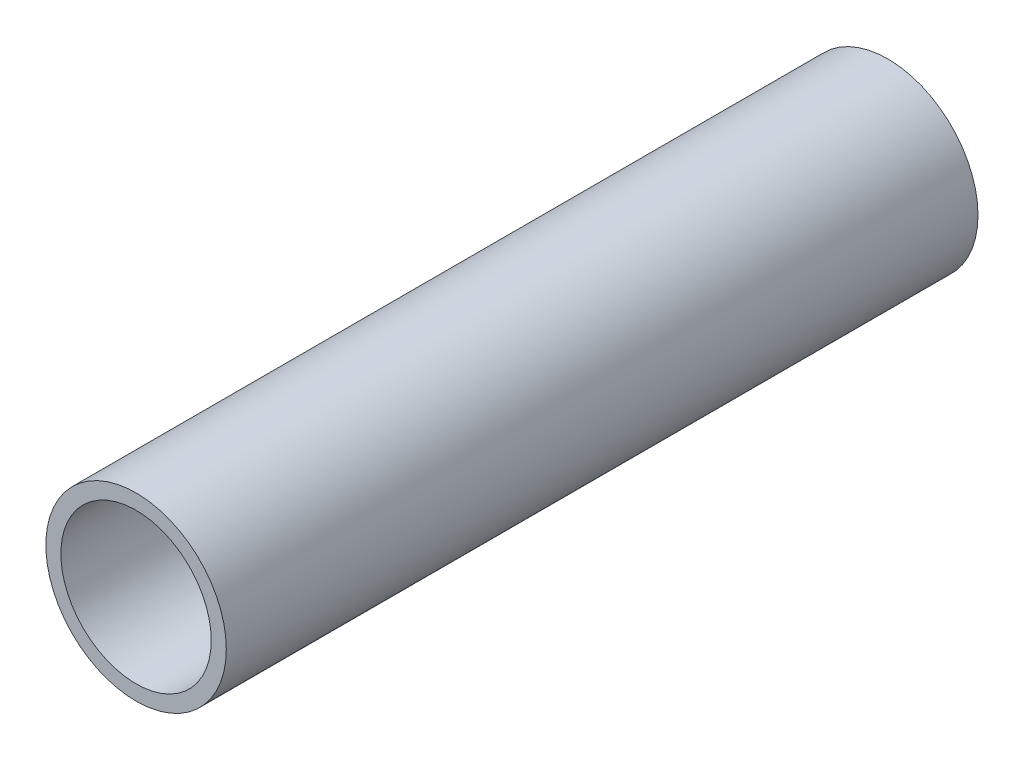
ISO-10303-21;
HEADER;
FILE_DESCRIPTION(('STEP AP214'),'2;1');
FILE_NAME('part.step','',(''),(''),'','','');
FILE_SCHEMA(('AUTOMOTIVE_DESIGN { 1 0 10303 214 1 1 1 1 }'));
ENDSEC;
DATA;
#1=APPLICATION_CONTEXT('core data for automotive mechanical design processes');
#2=APPLICATION_PROTOCOL_DEFINITION('international standard','automotive_design',2000,#1);
#3=PRODUCT_CONTEXT('',#1,'mechanical');
#4=PRODUCT('Part','Part','',(#3));
#5=PRODUCT_RELATED_PRODUCT_CATEGORY('part','',(#4));
#6=PRODUCT_DEFINITION_FORMATION('','',#4);
#7=PRODUCT_DEFINITION_CONTEXT('part definition',#1,'design');
#8=PRODUCT_DEFINITION('design','',#6,#7);
#9=PRODUCT_DEFINITION_SHAPE('','',#8);
#10=(LENGTH_UNIT() NAMED_UNIT(*) SI_UNIT(.MILLI.,.METRE.));
#11=(NAMED_UNIT(*) PLANE_ANGLE_UNIT() SI_UNIT($,.RADIAN.));
#12=(NAMED_UNIT(*) SI_UNIT($,.STERADIAN.) SOLID_ANGLE_UNIT());
#13=UNCERTAINTY_MEASURE_WITH_UNIT(LENGTH_MEASURE(1.E-05),#10,'distance_accuracy_value','');
#14=(GEOMETRIC_REPRESENTATION_CONTEXT(3) GLOBAL_UNCERTAINTY_ASSIGNED_CONTEXT((#13)) GLOBAL_UNIT_ASSIGNED_CONTEXT((#10,
#11,#12)) REPRESENTATION_CONTEXT('',''));
#15=CARTESIAN_POINT('',(0.,0.,0.));
#16=DIRECTION('',(0.,0.,1.));
#17=DIRECTION('',(1.,0.,0.));
#18=AXIS2_PLACEMENT_3D('',#15,#16,#17);
#19=CARTESIAN_POINT('',(0.,0.,249.95));
#20=DIRECTION('',(0.,0.,1.));
#21=DIRECTION('',(1.,0.,0.));
#22=AXIS2_PLACEMENT_3D('',#19,#20,#21);
#23=PLANE('',#22);
#24=CARTESIAN_POINT('',(0.,0.,249.95));
#25=DIRECTION('',(0.,0.,1.));
#26=DIRECTION('',(1.,0.,0.));
#27=AXIS2_PLACEMENT_3D('',#24,#25,#26);
#28=CIRCLE('',#27,60.);
#29=CARTESIAN_POINT('',(60.,0.,249.95));
#30=VERTEX_POINT('',#29);
#31=EDGE_CURVE('E10',#30,#30,#28,.T.);
#32=ORIENTED_EDGE('',*,*,#31,.T.);
#33=EDGE_LOOP('',(#32));
#34=FACE_BOUND('',#33,.T.);
#35=CARTESIAN_POINT('',(0.,0.,249.95));
#36=DIRECTION('',(0.,0.,1.));
#37=DIRECTION('',(1.,0.,0.));
#38=AXIS2_PLACEMENT_3D('',#35,#36,#37);
#39=CIRCLE('',#38,50.);
#40=CARTESIAN_POINT('',(50.,0.,249.95));
#41=VERTEX_POINT('',#40);
#42=EDGE_CURVE('E46',#41,#41,#39,.T.);
#43=ORIENTED_EDGE('',*,*,#42,.F.);
#44=EDGE_LOOP('',(#43));
#45=FACE_BOUND('',#44,.T.);
#46=ADVANCED_FACE('F35',(#34,#45),#23,.T.);
#47=CARTESIAN_POINT('',(0.,0.,-249.95));
#48=DIRECTION('',(0.,0.,1.));
#49=DIRECTION('',(1.,0.,0.));
#50=AXIS2_PLACEMENT_3D('',#47,#48,#49);
#51=PLANE('',#50);
#52=CARTESIAN_POINT('',(0.,0.,-249.95));
#53=DIRECTION('',(0.,0.,1.));
#54=DIRECTION('',(1.,0.,0.));
#55=AXIS2_PLACEMENT_3D('',#52,#53,#54);
#56=CIRCLE('',#55,60.);
#57=CARTESIAN_POINT('',(60.,0.,-249.95));
#58=VERTEX_POINT('',#57);
#59=EDGE_CURVE('E42',#58,#58,#56,.T.);
#60=ORIENTED_EDGE('',*,*,#59,.F.);
#61=EDGE_LOOP('',(#60));
#62=FACE_BOUND('',#61,.T.);
#63=CARTESIAN_POINT('',(0.,0.,-249.95));
#64=DIRECTION('',(0.,0.,1.));
#65=DIRECTION('',(1.,0.,0.));
#66=AXIS2_PLACEMENT_3D('',#63,#64,#65);
#67=CIRCLE('',#66,50.);
#68=CARTESIAN_POINT('',(50.,0.,-249.95));
#69=VERTEX_POINT('',#68);
#70=EDGE_CURVE('E50',#69,#69,#67,.T.);
#71=ORIENTED_EDGE('',*,*,#70,.T.);
#72=EDGE_LOOP('',(#71));
#73=FACE_BOUND('',#72,.T.);
#74=ADVANCED_FACE('F56',(#62,#73),#51,.F.);
#75=CARTESIAN_POINT('',(0.,0.,249.95));
#76=DIRECTION('',(0.,0.,-1.));
#77=DIRECTION('',(-1.,0.,0.));
#78=AXIS2_PLACEMENT_3D('',#75,#76,#77);
#79=CYLINDRICAL_SURFACE('',#78,60.);
#80=ORIENTED_EDGE('',*,*,#31,.F.);
#81=EDGE_LOOP('',(#80));
#82=FACE_BOUND('',#81,.T.);
#83=ORIENTED_EDGE('',*,*,#59,.T.);
#84=EDGE_LOOP('',(#83));
#85=FACE_BOUND('',#84,.T.);
#86=ADVANCED_FACE('F37',(#82,#85),#79,.T.);
#87=CARTESIAN_POINT('',(0.,0.,249.95));
#88=DIRECTION('',(0.,0.,-1.));
#89=DIRECTION('',(-1.,0.,0.));
#90=AXIS2_PLACEMENT_3D('',#87,#88,#89);
#91=CYLINDRICAL_SURFACE('',#90,50.);
#92=ORIENTED_EDGE('',*,*,#42,.T.);
#93=EDGE_LOOP('',(#92));
#94=FACE_BOUND('',#93,.T.);
#95=ORIENTED_EDGE('',*,*,#70,.F.);
#96=EDGE_LOOP('',(#95));
#97=FACE_BOUND('',#96,.T.);
#98=ADVANCED_FACE('F58',(#94,#97),#91,.F.);
#99=CLOSED_SHELL('',(#46,#74,#86,#98));
#100=MANIFOLD_SOLID_BREP('B2',#99);
#101=ADVANCED_BREP_SHAPE_REPRESENTATION('',(#18,#100),#14);
#102=SHAPE_DEFINITION_REPRESENTATION(#9,#101);
ENDSEC;
END-ISO-10303-21;
